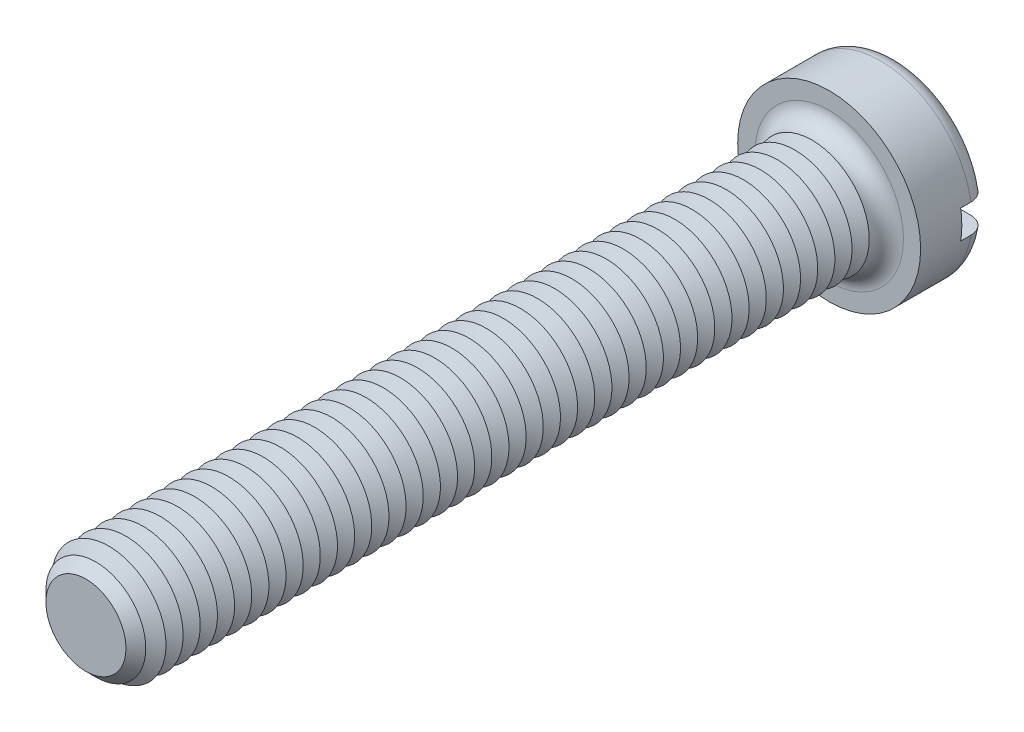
from build123d import *

# Parameters (mm, degrees)
SKETCH3_R           = 8
BOSS_EXTRUDE2_DEPTH = 6
SKETCH4_R           = 5
BOSS_EXTRUDE3_DEPTH = 65
FILLET1_R           = 1.5
CHAMFER1_SIZE       = 1.5
LPATTERN1_COUNT     = 42
LPATTERN1_PITCH     = 1.5
SKETCH8_W           = 16
SKETCH8_H           = 2.5
CUT_EXTRUDE1_DEPTH  = 2.4


with BuildPart() as part:
    # Sketch3 → Boss-Extrude2 (new body)
    with BuildSketch(Plane.XY):
        Circle(SKETCH3_R)
    extrude(amount=-BOSS_EXTRUDE2_DEPTH)

    # Sketch4 → Boss-Extrude3 (add)
    with BuildSketch(Plane.XY):
        Circle(SKETCH4_R)
    extrude(amount=BOSS_EXTRUDE3_DEPTH)

    # Fillet1
    fillet1_edges = [part.edges().sort_by_distance(p)[0] for p in [
        (-8, 0, -6),
        (-5, 0, 0),
    ]]
    fillet(fillet1_edges, radius=FILLET1_R)

    # Chamfer1
    chamfer1_edges = [part.edges().sort_by_distance(p)[0] for p in [
        (-5, 0, 65),
    ]]
    chamfer(chamfer1_edges, length=CHAMFER1_SIZE)

    # Sketch6 → Cut-Revolve1 (revolve, cut)
    with BuildSketch(Plane(origin=(0, 0, 0), x_dir=(0, 0, -1), z_dir=(1, 0, 0)), mode=Mode.PRIVATE) as cut_revolve1_sk:
        Polygon((-1.5, 5), (-2.25, 3.700961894), (-3, 5), align=None)
    cut_revolve1 = revolve(cut_revolve1_sk.sketch.rotate(Axis((0, 0, -1.694361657), (0, 0, 1)), 90), axis=Axis((0, 0, -1.694361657), (0, 0, 1)), mode=Mode.SUBTRACT)

    # LPattern1: Cut-Revolve1 ×42
    with Locations(*[(0, 0, i * LPATTERN1_PITCH) for i in range(1, LPATTERN1_COUNT)]):
        add(cut_revolve1, mode=Mode.SUBTRACT)

    # Sketch8 → Cut-Extrude1 (cut)
    with BuildSketch(Plane(origin=(0, 0, -6), x_dir=(-1, 0, 0), z_dir=(0, 0, -1))):
        Rectangle(SKETCH8_W, SKETCH8_H)
    extrude(amount=-CUT_EXTRUDE1_DEPTH, mode=Mode.SUBTRACT)


solid = part.part
